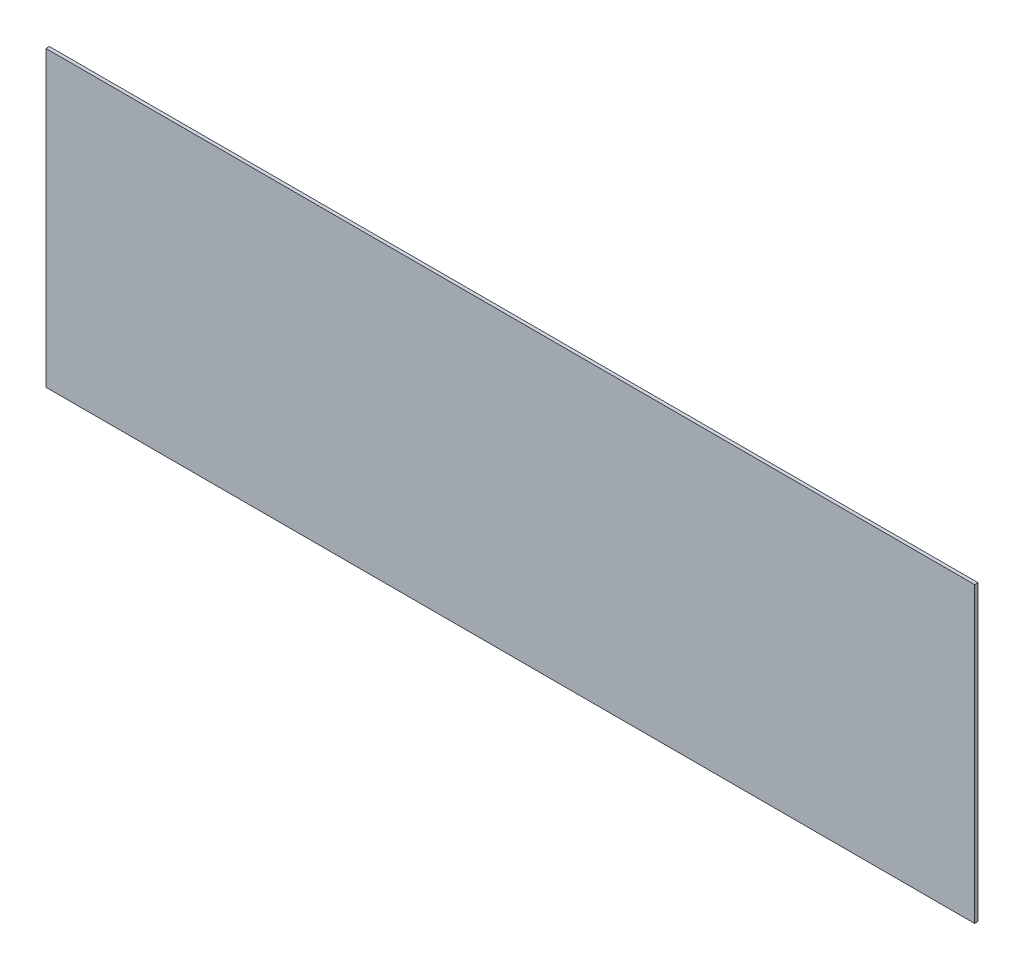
from build123d import *

# Parameters (mm, degrees)
SKETCH1_W           = 562.61
SKETCH1_H           = 177.8
BOSS_EXTRUDE1_DEPTH = 2.032


with BuildPart() as part:
    # Sketch1 → Boss-Extrude1 (new body)
    with BuildSketch(Plane.XY):
        with Locations((281.305, 88.9)):
            Rectangle(SKETCH1_W, SKETCH1_H)
    extrude(amount=BOSS_EXTRUDE1_DEPTH)


solid = part.part
